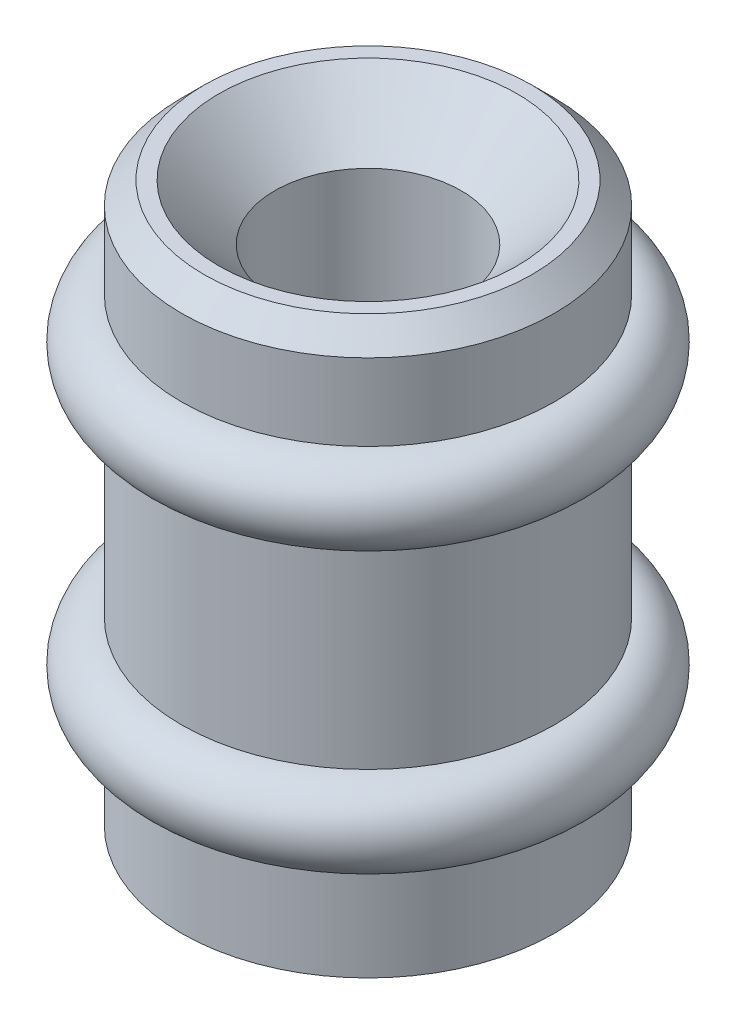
ISO-10303-21;
HEADER;
FILE_DESCRIPTION(('STEP AP214'),'2;1');
FILE_NAME('part.step','',(''),(''),'','','');
FILE_SCHEMA(('AUTOMOTIVE_DESIGN { 1 0 10303 214 1 1 1 1 }'));
ENDSEC;
DATA;
#1=APPLICATION_CONTEXT('core data for automotive mechanical design processes');
#2=APPLICATION_PROTOCOL_DEFINITION('international standard','automotive_design',2000,#1);
#3=PRODUCT_CONTEXT('',#1,'mechanical');
#4=PRODUCT('Part','Part','',(#3));
#5=PRODUCT_RELATED_PRODUCT_CATEGORY('part','',(#4));
#6=PRODUCT_DEFINITION_FORMATION('','',#4);
#7=PRODUCT_DEFINITION_CONTEXT('part definition',#1,'design');
#8=PRODUCT_DEFINITION('design','',#6,#7);
#9=PRODUCT_DEFINITION_SHAPE('','',#8);
#10=(LENGTH_UNIT() NAMED_UNIT(*) SI_UNIT(.MILLI.,.METRE.));
#11=(NAMED_UNIT(*) PLANE_ANGLE_UNIT() SI_UNIT($,.RADIAN.));
#12=(NAMED_UNIT(*) SI_UNIT($,.STERADIAN.) SOLID_ANGLE_UNIT());
#13=UNCERTAINTY_MEASURE_WITH_UNIT(LENGTH_MEASURE(1.E-05),#10,'distance_accuracy_value','');
#14=(GEOMETRIC_REPRESENTATION_CONTEXT(3) GLOBAL_UNCERTAINTY_ASSIGNED_CONTEXT((#13)) GLOBAL_UNIT_ASSIGNED_CONTEXT((#10,
#11,#12)) REPRESENTATION_CONTEXT('',''));
#15=CARTESIAN_POINT('',(0.,0.,0.));
#16=DIRECTION('',(0.,0.,1.));
#17=DIRECTION('',(1.,0.,0.));
#18=AXIS2_PLACEMENT_3D('',#15,#16,#17);
#19=CARTESIAN_POINT('',(0.,9.525,0.));
#20=DIRECTION('',(0.,-1.,0.));
#21=DIRECTION('',(0.,0.,-1.));
#22=AXIS2_PLACEMENT_3D('',#19,#20,#21);
#23=CYLINDRICAL_SURFACE('',#22,3.175);
#24=CARTESIAN_POINT('',(0.,3.075,0.));
#25=DIRECTION('',(0.,-1.,0.));
#26=DIRECTION('',(0.,0.,-1.));
#27=AXIS2_PLACEMENT_3D('',#24,#25,#26);
#28=CIRCLE('',#27,3.175);
#29=CARTESIAN_POINT('',(0.,3.075,-3.175));
#30=VERTEX_POINT('',#29);
#31=EDGE_CURVE('E73',#30,#30,#28,.T.);
#32=CARTESIAN_POINT('',(0.,6.45,0.));
#33=DIRECTION('',(0.,1.,0.));
#34=DIRECTION('',(0.,0.,1.));
#35=AXIS2_PLACEMENT_3D('',#32,#33,#34);
#36=CIRCLE('',#35,3.175);
#37=CARTESIAN_POINT('',(0.,6.45,-3.175));
#38=VERTEX_POINT('',#37);
#39=EDGE_CURVE('E64',#38,#38,#36,.T.);
#40=CARTESIAN_POINT('',(0.,3.075,-3.175));
#41=CARTESIAN_POINT('',(0.,3.11015625,-3.175));
#42=CARTESIAN_POINT('',(0.,3.1453125,-3.175));
#43=CARTESIAN_POINT('',(0.,3.215625,-3.175));
#44=CARTESIAN_POINT('',(0.,3.25078125,-3.175));
#45=CARTESIAN_POINT('',(0.,3.32109375,-3.175));
#46=CARTESIAN_POINT('',(0.,3.35625,-3.175));
#47=CARTESIAN_POINT('',(0.,3.4265625,-3.175));
#48=CARTESIAN_POINT('',(0.,3.46171875,-3.175));
#49=CARTESIAN_POINT('',(0.,3.53203125,-3.175));
#50=CARTESIAN_POINT('',(0.,3.5671875,-3.175));
#51=CARTESIAN_POINT('',(0.,3.6375,-3.175));
#52=CARTESIAN_POINT('',(0.,3.67265625,-3.175));
#53=CARTESIAN_POINT('',(0.,3.74296875,-3.175));
#54=CARTESIAN_POINT('',(0.,3.778125,-3.175));
#55=CARTESIAN_POINT('',(0.,3.8484375,-3.175));
#56=CARTESIAN_POINT('',(0.,3.88359375,-3.175));
#57=CARTESIAN_POINT('',(0.,3.95390625,-3.175));
#58=CARTESIAN_POINT('',(0.,3.9890625,-3.175));
#59=CARTESIAN_POINT('',(0.,4.059375,-3.175));
#60=CARTESIAN_POINT('',(0.,4.09453125,-3.175));
#61=CARTESIAN_POINT('',(0.,4.16484375,-3.175));
#62=CARTESIAN_POINT('',(0.,4.2,-3.175));
#63=CARTESIAN_POINT('',(0.,4.2703125,-3.175));
#64=CARTESIAN_POINT('',(0.,4.30546875,-3.175));
#65=CARTESIAN_POINT('',(0.,4.37578125,-3.175));
#66=CARTESIAN_POINT('',(0.,4.4109375,-3.175));
#67=CARTESIAN_POINT('',(0.,4.48125,-3.175));
#68=CARTESIAN_POINT('',(0.,4.51640625,-3.175));
#69=CARTESIAN_POINT('',(0.,4.58671875,-3.175));
#70=CARTESIAN_POINT('',(0.,4.621875,-3.175));
#71=CARTESIAN_POINT('',(0.,4.6921875,-3.175));
#72=CARTESIAN_POINT('',(0.,4.72734375,-3.175));
#73=CARTESIAN_POINT('',(0.,4.79765625,-3.175));
#74=CARTESIAN_POINT('',(0.,4.8328125,-3.175));
#75=CARTESIAN_POINT('',(0.,4.903125,-3.175));
#76=CARTESIAN_POINT('',(0.,4.93828125,-3.175));
#77=CARTESIAN_POINT('',(0.,5.00859375,-3.175));
#78=CARTESIAN_POINT('',(0.,5.04375,-3.175));
#79=CARTESIAN_POINT('',(0.,5.1140625,-3.175));
#80=CARTESIAN_POINT('',(0.,5.14921875,-3.175));
#81=CARTESIAN_POINT('',(0.,5.21953125,-3.175));
#82=CARTESIAN_POINT('',(0.,5.2546875,-3.175));
#83=CARTESIAN_POINT('',(0.,5.325,-3.175));
#84=CARTESIAN_POINT('',(0.,5.36015625,-3.175));
#85=CARTESIAN_POINT('',(0.,5.43046875,-3.175));
#86=CARTESIAN_POINT('',(0.,5.465625,-3.175));
#87=CARTESIAN_POINT('',(0.,5.5359375,-3.175));
#88=CARTESIAN_POINT('',(0.,5.57109375,-3.175));
#89=CARTESIAN_POINT('',(0.,5.64140625,-3.175));
#90=CARTESIAN_POINT('',(0.,5.6765625,-3.175));
#91=CARTESIAN_POINT('',(0.,5.746875,-3.175));
#92=CARTESIAN_POINT('',(0.,5.78203125,-3.175));
#93=CARTESIAN_POINT('',(0.,5.85234375,-3.175));
#94=CARTESIAN_POINT('',(0.,5.8875,-3.175));
#95=CARTESIAN_POINT('',(0.,5.9578125,-3.175));
#96=CARTESIAN_POINT('',(0.,5.99296875,-3.175));
#97=CARTESIAN_POINT('',(0.,6.06328125,-3.175));
#98=CARTESIAN_POINT('',(0.,6.0984375,-3.175));
#99=CARTESIAN_POINT('',(0.,6.16875,-3.175));
#100=CARTESIAN_POINT('',(0.,6.20390625,-3.175));
#101=CARTESIAN_POINT('',(0.,6.27421875,-3.175));
#102=CARTESIAN_POINT('',(0.,6.309375,-3.175));
#103=CARTESIAN_POINT('',(0.,6.3796875,-3.175));
#104=CARTESIAN_POINT('',(0.,6.41484375,-3.175));
#105=CARTESIAN_POINT('',(0.,6.45,-3.175));
#106=B_SPLINE_CURVE_WITH_KNOTS('',3,(#40,#41,#42,#43,#44,#45,#46,#47,#48,#49,#50,#51,#52,#53,
#54,#55,#56,#57,#58,#59,#60,#61,#62,#63,#64,#65,#66,#67,#68,#69,#70,#71,#72,#73,#74,#75,#76,#77,
#78,#79,#80,#81,#82,#83,#84,#85,#86,#87,#88,#89,#90,#91,#92,#93,#94,#95,#96,#97,#98,#99,#100,
#101,#102,#103,#104,#105),.UNSPECIFIED.,.F.,.F.,(4,2,2,2,2,2,2,2,2,2,2,2,2,2,2,2,2,2,2,2,2,2,2,
2,2,2,2,2,2,2,2,2,4),(0.,0.10546875,0.2109375,0.31640625,0.421875,0.52734375,0.6328125,
0.73828125,0.84375,0.94921875,1.0546875,1.16015625,1.265625,1.37109375,1.4765625,1.58203125,
1.6875,1.79296875,1.8984375,2.00390625,2.109375,2.21484375,2.3203125,2.42578125,2.53125,
2.63671875,2.7421875,2.84765625,2.953125,3.05859375,3.1640625,3.26953125,3.375),.UNSPECIFIED.);
#107=EDGE_CURVE('BSEAM43',#30,#38,#106,.T.);
#108=ORIENTED_EDGE('',*,*,#31,.F.);
#109=ORIENTED_EDGE('',*,*,#39,.F.);
#110=ORIENTED_EDGE('',*,*,#107,.T.);
#111=ORIENTED_EDGE('',*,*,#107,.F.);
#112=EDGE_LOOP('',(#108,#110,#109,#111));
#113=FACE_BOUND('',#112,.T.);
#114=ADVANCED_FACE('F43',(#113),#23,.T.);
#115=CARTESIAN_POINT('',(0.,0.,0.));
#116=DIRECTION('',(0.,1.,0.));
#117=DIRECTION('',(0.,0.,1.));
#118=AXIS2_PLACEMENT_3D('',#115,#116,#117);
#119=CIRCLE('',#118,3.175);
#120=CARTESIAN_POINT('',(0.,0.,-3.175));
#121=VERTEX_POINT('',#120);
#122=EDGE_CURVE('E76',#121,#121,#119,.T.);
#123=CARTESIAN_POINT('',(0.,1.6875,0.));
#124=DIRECTION('',(0.,1.,0.));
#125=DIRECTION('',(0.,0.,1.));
#126=AXIS2_PLACEMENT_3D('',#123,#124,#125);
#127=CIRCLE('',#126,3.175);
#128=CARTESIAN_POINT('',(0.,1.6875,-3.175));
#129=VERTEX_POINT('',#128);
#130=EDGE_CURVE('E70',#129,#129,#127,.T.);
#131=CARTESIAN_POINT('',(0.,0.,-3.175));
#132=CARTESIAN_POINT('',(0.,0.0175781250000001,-3.175));
#133=CARTESIAN_POINT('',(0.,0.0351562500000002,-3.175));
#134=CARTESIAN_POINT('',(0.,0.0703125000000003,-3.175));
#135=CARTESIAN_POINT('',(0.,0.0878906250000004,-3.175));
#136=CARTESIAN_POINT('',(0.,0.123046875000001,-3.175));
#137=CARTESIAN_POINT('',(0.,0.140625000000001,-3.175));
#138=CARTESIAN_POINT('',(0.,0.175781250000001,-3.175));
#139=CARTESIAN_POINT('',(0.,0.193359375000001,-3.175));
#140=CARTESIAN_POINT('',(0.,0.228515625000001,-3.175));
#141=CARTESIAN_POINT('',(0.,0.24609375,-3.175));
#142=CARTESIAN_POINT('',(0.,0.28125,-3.175));
#143=CARTESIAN_POINT('',(0.,0.298828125,-3.175));
#144=CARTESIAN_POINT('',(0.,0.333984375,-3.175));
#145=CARTESIAN_POINT('',(0.,0.3515625,-3.175));
#146=CARTESIAN_POINT('',(0.,0.38671875,-3.175));
#147=CARTESIAN_POINT('',(0.,0.404296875,-3.175));
#148=CARTESIAN_POINT('',(0.,0.439453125,-3.175));
#149=CARTESIAN_POINT('',(0.,0.457031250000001,-3.175));
#150=CARTESIAN_POINT('',(0.,0.492187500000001,-3.175));
#151=CARTESIAN_POINT('',(0.,0.509765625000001,-3.175));
#152=CARTESIAN_POINT('',(0.,0.544921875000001,-3.175));
#153=CARTESIAN_POINT('',(0.,0.562500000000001,-3.175));
#154=CARTESIAN_POINT('',(0.,0.597656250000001,-3.175));
#155=CARTESIAN_POINT('',(0.,0.615234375,-3.175));
#156=CARTESIAN_POINT('',(0.,0.650390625,-3.175));
#157=CARTESIAN_POINT('',(0.,0.66796875,-3.175));
#158=CARTESIAN_POINT('',(0.,0.703125,-3.175));
#159=CARTESIAN_POINT('',(0.,0.720703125,-3.175));
#160=CARTESIAN_POINT('',(0.,0.755859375,-3.175));
#161=CARTESIAN_POINT('',(0.,0.7734375,-3.175));
#162=CARTESIAN_POINT('',(0.,0.808593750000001,-3.175));
#163=CARTESIAN_POINT('',(0.,0.826171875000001,-3.175));
#164=CARTESIAN_POINT('',(0.,0.861328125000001,-3.175));
#165=CARTESIAN_POINT('',(0.,0.878906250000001,-3.175));
#166=CARTESIAN_POINT('',(0.,0.914062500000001,-3.175));
#167=CARTESIAN_POINT('',(0.,0.931640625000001,-3.175));
#168=CARTESIAN_POINT('',(0.,0.966796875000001,-3.175));
#169=CARTESIAN_POINT('',(0.,0.984375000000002,-3.175));
#170=CARTESIAN_POINT('',(0.,1.01953125,-3.175));
#171=CARTESIAN_POINT('',(0.,1.037109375,-3.175));
#172=CARTESIAN_POINT('',(0.,1.072265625,-3.175));
#173=CARTESIAN_POINT('',(0.,1.08984375,-3.175));
#174=CARTESIAN_POINT('',(0.,1.125,-3.175));
#175=CARTESIAN_POINT('',(0.,1.142578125,-3.175));
#176=CARTESIAN_POINT('',(0.,1.177734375,-3.175));
#177=CARTESIAN_POINT('',(0.,1.1953125,-3.175));
#178=CARTESIAN_POINT('',(0.,1.23046875,-3.175));
#179=CARTESIAN_POINT('',(0.,1.248046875,-3.175));
#180=CARTESIAN_POINT('',(0.,1.283203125,-3.175));
#181=CARTESIAN_POINT('',(0.,1.30078125,-3.175));
#182=CARTESIAN_POINT('',(0.,1.3359375,-3.175));
#183=CARTESIAN_POINT('',(0.,1.353515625,-3.175));
#184=CARTESIAN_POINT('',(0.,1.388671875,-3.175));
#185=CARTESIAN_POINT('',(0.,1.40625,-3.175));
#186=CARTESIAN_POINT('',(0.,1.44140625,-3.175));
#187=CARTESIAN_POINT('',(0.,1.458984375,-3.175));
#188=CARTESIAN_POINT('',(0.,1.494140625,-3.175));
#189=CARTESIAN_POINT('',(0.,1.51171875,-3.175));
#190=CARTESIAN_POINT('',(0.,1.546875,-3.175));
#191=CARTESIAN_POINT('',(0.,1.564453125,-3.175));
#192=CARTESIAN_POINT('',(0.,1.599609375,-3.175));
#193=CARTESIAN_POINT('',(0.,1.6171875,-3.175));
#194=CARTESIAN_POINT('',(0.,1.65234375,-3.175));
#195=CARTESIAN_POINT('',(0.,1.669921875,-3.175));
#196=CARTESIAN_POINT('',(0.,1.6875,-3.175));
#197=B_SPLINE_CURVE_WITH_KNOTS('',3,(#131,#132,#133,#134,#135,#136,#137,#138,#139,#140,#141,
#142,#143,#144,#145,#146,#147,#148,#149,#150,#151,#152,#153,#154,#155,#156,#157,#158,#159,#160,
#161,#162,#163,#164,#165,#166,#167,#168,#169,#170,#171,#172,#173,#174,#175,#176,#177,#178,#179,
#180,#181,#182,#183,#184,#185,#186,#187,#188,#189,#190,#191,#192,#193,#194,#195,#196),
.UNSPECIFIED.,.F.,.F.,(4,2,2,2,2,2,2,2,2,2,2,2,2,2,2,2,2,2,2,2,2,2,2,2,2,2,2,2,2,2,2,2,4),(0.,
0.0527343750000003,0.105468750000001,0.158203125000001,0.210937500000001,0.263671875,0.31640625,
0.369140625,0.421875,0.474609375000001,0.527343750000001,0.580078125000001,0.6328125,
0.685546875,0.73828125,0.791015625,0.843750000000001,0.896484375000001,0.949218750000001,
1.001953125,1.0546875,1.107421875,1.16015625,1.212890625,1.265625,1.318359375,1.37109375,
1.423828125,1.4765625,1.529296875,1.58203125,1.634765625,1.6875),.UNSPECIFIED.);
#198=EDGE_CURVE('BSEAM100',#121,#129,#197,.T.);
#199=ORIENTED_EDGE('',*,*,#122,.T.);
#200=ORIENTED_EDGE('',*,*,#130,.F.);
#201=ORIENTED_EDGE('',*,*,#198,.T.);
#202=ORIENTED_EDGE('',*,*,#198,.F.);
#203=EDGE_LOOP('',(#199,#201,#200,#202));
#204=FACE_BOUND('',#203,.T.);
#205=ADVANCED_FACE('F100',(#204),#23,.T.);
#206=CARTESIAN_POINT('',(0.,0.,0.));
#207=DIRECTION('',(0.,1.,0.));
#208=DIRECTION('',(0.,0.,1.));
#209=AXIS2_PLACEMENT_3D('',#206,#207,#208);
#210=PLANE('',#209);
#211=CARTESIAN_POINT('',(0.,0.,0.));
#212=DIRECTION('',(0.,1.,0.));
#213=DIRECTION('',(0.,0.,1.));
#214=AXIS2_PLACEMENT_3D('',#211,#212,#213);
#215=CIRCLE('',#214,1.5875);
#216=CARTESIAN_POINT('',(0.,0.,1.5875));
#217=VERTEX_POINT('',#216);
#218=EDGE_CURVE('E79',#217,#217,#215,.T.);
#219=ORIENTED_EDGE('',*,*,#218,.T.);
#220=EDGE_LOOP('',(#219));
#221=FACE_BOUND('',#220,.T.);
#222=ORIENTED_EDGE('',*,*,#122,.F.);
#223=EDGE_LOOP('',(#222));
#224=FACE_BOUND('',#223,.T.);
#225=ADVANCED_FACE('F83',(#221,#224),#210,.F.);
#226=CARTESIAN_POINT('',(0.,2.38125,0.));
#227=DIRECTION('',(0.,-1.,0.));
#228=DIRECTION('',(0.,0.,-1.));
#229=AXIS2_PLACEMENT_3D('',#226,#227,#228);
#230=TOROIDAL_SURFACE('',#229,3.175,0.69375);
#231=ORIENTED_EDGE('',*,*,#130,.T.);
#232=EDGE_LOOP('',(#231));
#233=FACE_BOUND('',#232,.T.);
#234=ORIENTED_EDGE('',*,*,#31,.T.);
#235=EDGE_LOOP('',(#234));
#236=FACE_BOUND('',#235,.T.);
#237=ADVANCED_FACE('F117',(#233,#236),#230,.T.);
#238=CARTESIAN_POINT('',(0.,7.14375,0.));
#239=DIRECTION('',(0.,-1.,0.));
#240=DIRECTION('',(0.,0.,-1.));
#241=AXIS2_PLACEMENT_3D('',#238,#239,#240);
#242=TOROIDAL_SURFACE('',#241,3.175,0.69375);
#243=ORIENTED_EDGE('',*,*,#39,.T.);
#244=EDGE_LOOP('',(#243));
#245=FACE_BOUND('',#244,.T.);
#246=CARTESIAN_POINT('',(0.,7.8375,0.));
#247=DIRECTION('',(0.,-1.,0.));
#248=DIRECTION('',(0.,0.,-1.));
#249=AXIS2_PLACEMENT_3D('',#246,#247,#248);
#250=CIRCLE('',#249,3.175);
#251=CARTESIAN_POINT('',(0.,7.8375,-3.175));
#252=VERTEX_POINT('',#251);
#253=EDGE_CURVE('E67',#252,#252,#250,.T.);
#254=ORIENTED_EDGE('',*,*,#253,.T.);
#255=EDGE_LOOP('',(#254));
#256=FACE_BOUND('',#255,.T.);
#257=ADVANCED_FACE('F120',(#245,#256),#242,.T.);
#258=CARTESIAN_POINT('',(0.,9.525,0.));
#259=DIRECTION('',(0.,1.,0.));
#260=DIRECTION('',(0.,0.,1.));
#261=AXIS2_PLACEMENT_3D('',#258,#259,#260);
#262=PLANE('',#261);
#263=CARTESIAN_POINT('',(0.,9.525,0.));
#264=DIRECTION('',(0.,1.,0.));
#265=DIRECTION('',(0.,0.,1.));
#266=AXIS2_PLACEMENT_3D('',#263,#264,#265);
#267=CIRCLE('',#266,2.79400000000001);
#268=CARTESIAN_POINT('',(0.,9.525,2.79400000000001));
#269=VERTEX_POINT('',#268);
#270=EDGE_CURVE('E51',#269,#269,#267,.T.);
#271=ORIENTED_EDGE('',*,*,#270,.T.);
#272=EDGE_LOOP('',(#271));
#273=FACE_BOUND('',#272,.T.);
#274=CARTESIAN_POINT('',(0.,9.525,0.));
#275=DIRECTION('',(0.,1.,0.));
#276=DIRECTION('',(0.,0.,1.));
#277=AXIS2_PLACEMENT_3D('',#274,#275,#276);
#278=CIRCLE('',#277,2.54000000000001);
#279=CARTESIAN_POINT('',(0.,9.525,2.54));
#280=VERTEX_POINT('',#279);
#281=EDGE_CURVE('E55',#280,#280,#278,.F.);
#282=ORIENTED_EDGE('',*,*,#281,.T.);
#283=EDGE_LOOP('',(#282));
#284=FACE_BOUND('',#283,.T.);
#285=ADVANCED_FACE('F98',(#273,#284),#262,.T.);
#286=CARTESIAN_POINT('',(0.,9.14400000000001,0.));
#287=DIRECTION('',(0.,1.,0.));
#288=DIRECTION('',(0.,0.,1.));
#289=AXIS2_PLACEMENT_3D('',#286,#287,#288);
#290=CIRCLE('',#289,3.175);
#291=CARTESIAN_POINT('',(0.,9.14400000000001,-3.175));
#292=VERTEX_POINT('',#291);
#293=EDGE_CURVE('E10',#292,#292,#290,.F.);
#294=CARTESIAN_POINT('',(0.,9.14400000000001,-3.175));
#295=CARTESIAN_POINT('',(0.,9.13039062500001,-3.175));
#296=CARTESIAN_POINT('',(0.,9.11678125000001,-3.175));
#297=CARTESIAN_POINT('',(0.,9.08956250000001,-3.175));
#298=CARTESIAN_POINT('',(0.,9.07595312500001,-3.175));
#299=CARTESIAN_POINT('',(0.,9.04873437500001,-3.175));
#300=CARTESIAN_POINT('',(0.,9.03512500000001,-3.175));
#301=CARTESIAN_POINT('',(0.,9.00790625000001,-3.175));
#302=CARTESIAN_POINT('',(0.,8.99429687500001,-3.175));
#303=CARTESIAN_POINT('',(0.,8.96707812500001,-3.175));
#304=CARTESIAN_POINT('',(0.,8.95346875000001,-3.175));
#305=CARTESIAN_POINT('',(0.,8.92625000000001,-3.175));
#306=CARTESIAN_POINT('',(0.,8.91264062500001,-3.175));
#307=CARTESIAN_POINT('',(0.,8.88542187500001,-3.175));
#308=CARTESIAN_POINT('',(0.,8.87181250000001,-3.175));
#309=CARTESIAN_POINT('',(0.,8.84459375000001,-3.175));
#310=CARTESIAN_POINT('',(0.,8.83098437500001,-3.175));
#311=CARTESIAN_POINT('',(0.,8.80376562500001,-3.175));
#312=CARTESIAN_POINT('',(0.,8.79015625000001,-3.175));
#313=CARTESIAN_POINT('',(0.,8.76293750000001,-3.175));
#314=CARTESIAN_POINT('',(0.,8.74932812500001,-3.175));
#315=CARTESIAN_POINT('',(0.,8.72210937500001,-3.175));
#316=CARTESIAN_POINT('',(0.,8.70850000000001,-3.175));
#317=CARTESIAN_POINT('',(0.,8.68128125,-3.175));
#318=CARTESIAN_POINT('',(0.,8.66767187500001,-3.175));
#319=CARTESIAN_POINT('',(0.,8.64045312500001,-3.175));
#320=CARTESIAN_POINT('',(0.,8.62684375,-3.175));
#321=CARTESIAN_POINT('',(0.,8.59962500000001,-3.175));
#322=CARTESIAN_POINT('',(0.,8.58601562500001,-3.175));
#323=CARTESIAN_POINT('',(0.,8.55879687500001,-3.175));
#324=CARTESIAN_POINT('',(0.,8.54518750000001,-3.175));
#325=CARTESIAN_POINT('',(0.,8.51796875,-3.175));
#326=CARTESIAN_POINT('',(0.,8.50435937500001,-3.175));
#327=CARTESIAN_POINT('',(0.,8.47714062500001,-3.175));
#328=CARTESIAN_POINT('',(0.,8.46353125,-3.175));
#329=CARTESIAN_POINT('',(0.,8.4363125,-3.175));
#330=CARTESIAN_POINT('',(0.,8.42270312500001,-3.175));
#331=CARTESIAN_POINT('',(0.,8.395484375,-3.175));
#332=CARTESIAN_POINT('',(0.,8.381875,-3.175));
#333=CARTESIAN_POINT('',(0.,8.35465625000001,-3.175));
#334=CARTESIAN_POINT('',(0.,8.341046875,-3.175));
#335=CARTESIAN_POINT('',(0.,8.313828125,-3.175));
#336=CARTESIAN_POINT('',(0.,8.30021875,-3.175));
#337=CARTESIAN_POINT('',(0.,8.27300000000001,-3.175));
#338=CARTESIAN_POINT('',(0.,8.259390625,-3.175));
#339=CARTESIAN_POINT('',(0.,8.232171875,-3.175));
#340=CARTESIAN_POINT('',(0.,8.2185625,-3.175));
#341=CARTESIAN_POINT('',(0.,8.19134375,-3.175));
#342=CARTESIAN_POINT('',(0.,8.177734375,-3.175));
#343=CARTESIAN_POINT('',(0.,8.150515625,-3.175));
#344=CARTESIAN_POINT('',(0.,8.13690625,-3.175));
#345=CARTESIAN_POINT('',(0.,8.1096875,-3.175));
#346=CARTESIAN_POINT('',(0.,8.096078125,-3.175));
#347=CARTESIAN_POINT('',(0.,8.068859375,-3.175));
#348=CARTESIAN_POINT('',(0.,8.05525,-3.175));
#349=CARTESIAN_POINT('',(0.,8.02803125,-3.175));
#350=CARTESIAN_POINT('',(0.,8.014421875,-3.175));
#351=CARTESIAN_POINT('',(0.,7.987203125,-3.175));
#352=CARTESIAN_POINT('',(0.,7.97359375,-3.175));
#353=CARTESIAN_POINT('',(0.,7.946375,-3.175));
#354=CARTESIAN_POINT('',(0.,7.932765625,-3.175));
#355=CARTESIAN_POINT('',(0.,7.905546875,-3.175));
#356=CARTESIAN_POINT('',(0.,7.8919375,-3.175));
#357=CARTESIAN_POINT('',(0.,7.86471875,-3.175));
#358=CARTESIAN_POINT('',(0.,7.851109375,-3.175));
#359=CARTESIAN_POINT('',(0.,7.8375,-3.175));
#360=B_SPLINE_CURVE_WITH_KNOTS('',3,(#294,#295,#296,#297,#298,#299,#300,#301,#302,#303,#304,
#305,#306,#307,#308,#309,#310,#311,#312,#313,#314,#315,#316,#317,#318,#319,#320,#321,#322,#323,
#324,#325,#326,#327,#328,#329,#330,#331,#332,#333,#334,#335,#336,#337,#338,#339,#340,#341,#342,
#343,#344,#345,#346,#347,#348,#349,#350,#351,#352,#353,#354,#355,#356,#357,#358,#359),
.UNSPECIFIED.,.F.,.F.,(4,2,2,2,2,2,2,2,2,2,2,2,2,2,2,2,2,2,2,2,2,2,2,2,2,2,2,2,2,2,2,2,4),(0.,
0.0408281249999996,0.0816562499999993,0.122484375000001,0.1633125,0.204140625,0.244968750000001,
0.285796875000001,0.326625,0.367453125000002,0.408281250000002,0.449109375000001,
0.489937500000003,0.530765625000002,0.571593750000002,0.612421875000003,0.653250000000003,
0.694078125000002,0.734906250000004,0.775734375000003,0.816562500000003,0.857390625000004,
0.898218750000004,0.939046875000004,0.979875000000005,1.020703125,1.06153125,1.10235937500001,
1.14318750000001,1.184015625,1.22484375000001,1.26567187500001,1.30650000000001),.UNSPECIFIED.);
#361=EDGE_CURVE('BSEAM89',#292,#252,#360,.T.);
#362=ORIENTED_EDGE('',*,*,#293,.T.);
#363=ORIENTED_EDGE('',*,*,#253,.F.);
#364=ORIENTED_EDGE('',*,*,#361,.T.);
#365=ORIENTED_EDGE('',*,*,#361,.F.);
#366=EDGE_LOOP('',(#362,#364,#363,#365));
#367=FACE_BOUND('',#366,.T.);
#368=ADVANCED_FACE('F89',(#367),#23,.T.);
#369=CARTESIAN_POINT('',(0.,-3.175,0.));
#370=DIRECTION('',(0.,1.,0.));
#371=DIRECTION('',(0.,0.,1.));
#372=AXIS2_PLACEMENT_3D('',#369,#370,#371);
#373=CYLINDRICAL_SURFACE('',#372,1.5875);
#374=CARTESIAN_POINT('',(0.,8.5725,0.));
#375=DIRECTION('',(0.,1.,0.));
#376=DIRECTION('',(0.,0.,1.));
#377=AXIS2_PLACEMENT_3D('',#374,#375,#376);
#378=CIRCLE('',#377,1.5875);
#379=CARTESIAN_POINT('',(0.,8.5725,1.5875));
#380=VERTEX_POINT('',#379);
#381=EDGE_CURVE('E59',#380,#380,#378,.T.);
#382=ORIENTED_EDGE('',*,*,#381,.T.);
#383=EDGE_LOOP('',(#382));
#384=FACE_BOUND('',#383,.T.);
#385=ORIENTED_EDGE('',*,*,#218,.F.);
#386=EDGE_LOOP('',(#385));
#387=FACE_BOUND('',#386,.T.);
#388=ADVANCED_FACE('F86',(#384,#387),#373,.F.);
#389=CARTESIAN_POINT('',(0.,8.5725,0.));
#390=DIRECTION('',(0.,1.,0.));
#391=DIRECTION('',(0.,0.,1.));
#392=AXIS2_PLACEMENT_3D('',#389,#390,#391);
#393=CONICAL_SURFACE('',#392,1.5875,0.78539816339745);
#394=CARTESIAN_POINT('',(0.,9.525,2.54));
#395=CARTESIAN_POINT('',(0.,9.515078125,2.53007812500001));
#396=CARTESIAN_POINT('',(0.,9.50515625,2.52015625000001));
#397=CARTESIAN_POINT('',(0.,9.4853125,2.50031250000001));
#398=CARTESIAN_POINT('',(0.,9.475390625,2.49039062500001));
#399=CARTESIAN_POINT('',(0.,9.455546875,2.47054687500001));
#400=CARTESIAN_POINT('',(0.,9.445625,2.460625));
#401=CARTESIAN_POINT('',(0.,9.42578125,2.44078125));
#402=CARTESIAN_POINT('',(0.,9.415859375,2.430859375));
#403=CARTESIAN_POINT('',(0.,9.396015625,2.411015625));
#404=CARTESIAN_POINT('',(0.,9.38609375,2.40109375));
#405=CARTESIAN_POINT('',(0.,9.36625,2.38125));
#406=CARTESIAN_POINT('',(0.,9.356328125,2.371328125));
#407=CARTESIAN_POINT('',(0.,9.336484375,2.351484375));
#408=CARTESIAN_POINT('',(0.,9.3265625,2.3415625));
#409=CARTESIAN_POINT('',(0.,9.30671875,2.32171875));
#410=CARTESIAN_POINT('',(0.,9.296796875,2.311796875));
#411=CARTESIAN_POINT('',(0.,9.276953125,2.291953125));
#412=CARTESIAN_POINT('',(0.,9.26703125,2.28203125));
#413=CARTESIAN_POINT('',(0.,9.2471875,2.2621875));
#414=CARTESIAN_POINT('',(0.,9.237265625,2.252265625));
#415=CARTESIAN_POINT('',(0.,9.217421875,2.232421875));
#416=CARTESIAN_POINT('',(0.,9.2075,2.2225));
#417=CARTESIAN_POINT('',(0.,9.18765625,2.20265625));
#418=CARTESIAN_POINT('',(0.,9.177734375,2.192734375));
#419=CARTESIAN_POINT('',(0.,9.157890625,2.172890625));
#420=CARTESIAN_POINT('',(0.,9.14796875,2.16296875));
#421=CARTESIAN_POINT('',(0.,9.128125,2.143125));
#422=CARTESIAN_POINT('',(0.,9.118203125,2.133203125));
#423=CARTESIAN_POINT('',(0.,9.098359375,2.113359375));
#424=CARTESIAN_POINT('',(0.,9.0884375,2.1034375));
#425=CARTESIAN_POINT('',(0.,9.06859375,2.08359375));
#426=CARTESIAN_POINT('',(0.,9.058671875,2.073671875));
#427=CARTESIAN_POINT('',(0.,9.038828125,2.053828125));
#428=CARTESIAN_POINT('',(0.,9.02890625,2.04390625));
#429=CARTESIAN_POINT('',(0.,9.0090625,2.0240625));
#430=CARTESIAN_POINT('',(0.,8.999140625,2.014140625));
#431=CARTESIAN_POINT('',(0.,8.979296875,1.994296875));
#432=CARTESIAN_POINT('',(0.,8.969375,1.984375));
#433=CARTESIAN_POINT('',(0.,8.94953125,1.96453125));
#434=CARTESIAN_POINT('',(0.,8.939609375,1.954609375));
#435=CARTESIAN_POINT('',(0.,8.919765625,1.934765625));
#436=CARTESIAN_POINT('',(0.,8.90984375,1.92484375));
#437=CARTESIAN_POINT('',(0.,8.89,1.905));
#438=CARTESIAN_POINT('',(0.,8.880078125,1.895078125));
#439=CARTESIAN_POINT('',(0.,8.860234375,1.875234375));
#440=CARTESIAN_POINT('',(0.,8.8503125,1.8653125));
#441=CARTESIAN_POINT('',(0.,8.83046875,1.84546875));
#442=CARTESIAN_POINT('',(0.,8.820546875,1.835546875));
#443=CARTESIAN_POINT('',(0.,8.800703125,1.815703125));
#444=CARTESIAN_POINT('',(0.,8.79078125,1.80578125));
#445=CARTESIAN_POINT('',(0.,8.7709375,1.7859375));
#446=CARTESIAN_POINT('',(0.,8.761015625,1.776015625));
#447=CARTESIAN_POINT('',(0.,8.741171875,1.756171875));
#448=CARTESIAN_POINT('',(0.,8.73125,1.74625));
#449=CARTESIAN_POINT('',(0.,8.71140625,1.72640625));
#450=CARTESIAN_POINT('',(0.,8.701484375,1.716484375));
#451=CARTESIAN_POINT('',(0.,8.681640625,1.696640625));
#452=CARTESIAN_POINT('',(0.,8.67171875,1.68671875));
#453=CARTESIAN_POINT('',(0.,8.651875,1.666875));
#454=CARTESIAN_POINT('',(0.,8.641953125,1.656953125));
#455=CARTESIAN_POINT('',(0.,8.622109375,1.637109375));
#456=CARTESIAN_POINT('',(0.,8.6121875,1.6271875));
#457=CARTESIAN_POINT('',(0.,8.59234375,1.60734375));
#458=CARTESIAN_POINT('',(0.,8.582421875,1.597421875));
#459=CARTESIAN_POINT('',(0.,8.5725,1.5875));
#460=B_SPLINE_CURVE_WITH_KNOTS('',3,(#394,#395,#396,#397,#398,#399,#400,#401,#402,#403,#404,
#405,#406,#407,#408,#409,#410,#411,#412,#413,#414,#415,#416,#417,#418,#419,#420,#421,#422,#423,
#424,#425,#426,#427,#428,#429,#430,#431,#432,#433,#434,#435,#436,#437,#438,#439,#440,#441,#442,
#443,#444,#445,#446,#447,#448,#449,#450,#451,#452,#453,#454,#455,#456,#457,#458,#459),
.UNSPECIFIED.,.F.,.F.,(4,2,2,2,2,2,2,2,2,2,2,2,2,2,2,2,2,2,2,2,2,2,2,2,2,2,2,2,2,2,2,2,4),(0.,
0.042094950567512,0.0841899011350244,0.126284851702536,0.168379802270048,0.21047475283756,
0.252569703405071,0.294664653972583,0.336759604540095,0.378854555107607,0.420949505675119,
0.46304445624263,0.505139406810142,0.547234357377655,0.589329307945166,0.631424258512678,
0.673519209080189,0.715614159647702,0.757709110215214,0.799804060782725,0.841899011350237,
0.883993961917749,0.926088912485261,0.968183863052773,1.01027881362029,1.0523737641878,
1.09446871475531,1.13656366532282,1.17865861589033,1.22075356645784,1.26284851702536,
1.30494346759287,1.34703841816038),.UNSPECIFIED.);
#461=EDGE_CURVE('BSEAM88',#280,#380,#460,.T.);
#462=ORIENTED_EDGE('',*,*,#281,.F.);
#463=ORIENTED_EDGE('',*,*,#381,.F.);
#464=ORIENTED_EDGE('',*,*,#461,.T.);
#465=ORIENTED_EDGE('',*,*,#461,.F.);
#466=EDGE_LOOP('',(#462,#464,#463,#465));
#467=FACE_BOUND('',#466,.T.);
#468=ADVANCED_FACE('F88',(#467),#393,.F.);
#469=CARTESIAN_POINT('',(0.,9.525,0.));
#470=DIRECTION('',(0.,-1.,0.));
#471=DIRECTION('',(0.,0.,-1.));
#472=AXIS2_PLACEMENT_3D('',#469,#470,#471);
#473=CONICAL_SURFACE('',#472,2.79400000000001,0.785398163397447);
#474=ORIENTED_EDGE('',*,*,#293,.F.);
#475=EDGE_LOOP('',(#474));
#476=FACE_BOUND('',#475,.T.);
#477=ORIENTED_EDGE('',*,*,#270,.F.);
#478=EDGE_LOOP('',(#477));
#479=FACE_BOUND('',#478,.T.);
#480=ADVANCED_FACE('F46',(#476,#479),#473,.T.);
#481=CLOSED_SHELL('',(#114,#205,#225,#237,#257,#285,#368,#388,#468,#480));
#482=MANIFOLD_SOLID_BREP('B2',#481);
#483=ADVANCED_BREP_SHAPE_REPRESENTATION('',(#18,#482),#14);
#484=SHAPE_DEFINITION_REPRESENTATION(#9,#483);
ENDSEC;
END-ISO-10303-21;
